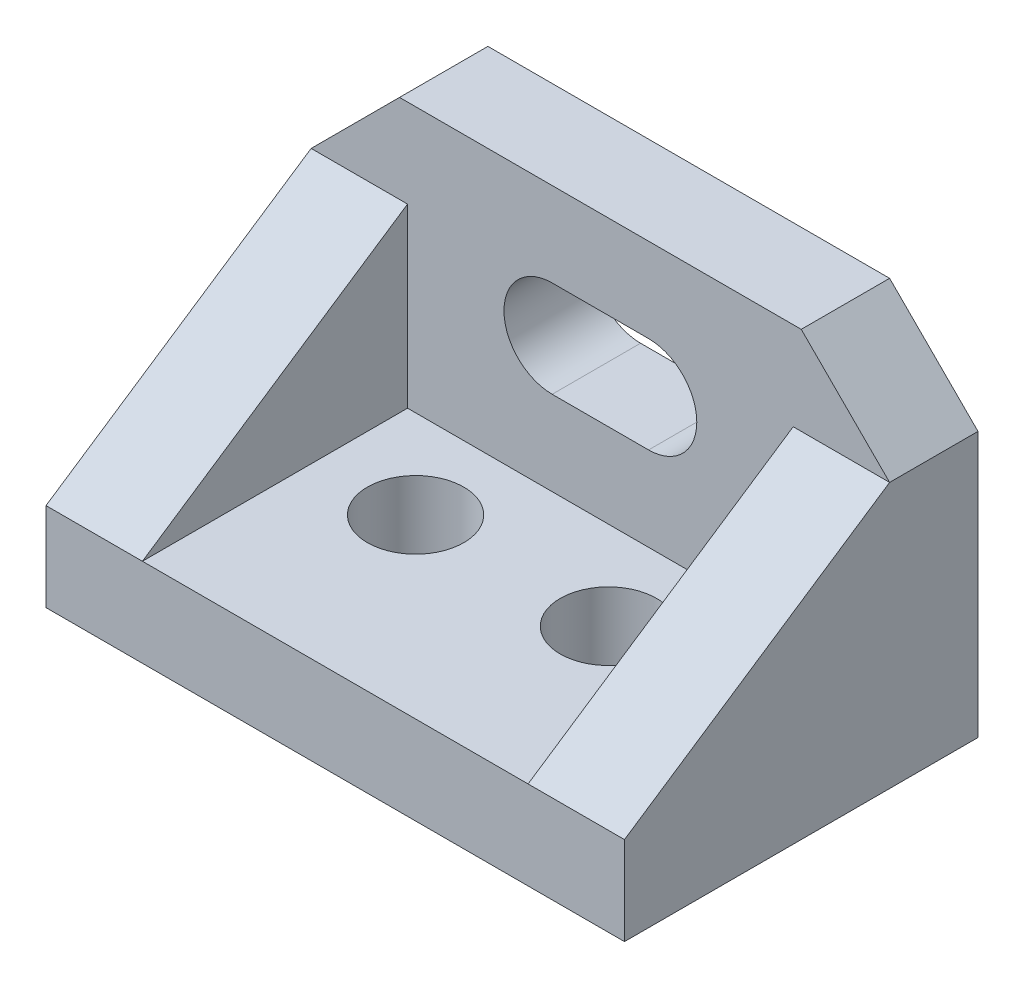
ISO-10303-21;
HEADER;
FILE_DESCRIPTION(('STEP AP214'),'2;1');
FILE_NAME('part.step','',(''),(''),'','','');
FILE_SCHEMA(('AUTOMOTIVE_DESIGN { 1 0 10303 214 1 1 1 1 }'));
ENDSEC;
DATA;
#1=APPLICATION_CONTEXT('core data for automotive mechanical design processes');
#2=APPLICATION_PROTOCOL_DEFINITION('international standard','automotive_design',2000,#1);
#3=PRODUCT_CONTEXT('',#1,'mechanical');
#4=PRODUCT('Part','Part','',(#3));
#5=PRODUCT_RELATED_PRODUCT_CATEGORY('part','',(#4));
#6=PRODUCT_DEFINITION_FORMATION('','',#4);
#7=PRODUCT_DEFINITION_CONTEXT('part definition',#1,'design');
#8=PRODUCT_DEFINITION('design','',#6,#7);
#9=PRODUCT_DEFINITION_SHAPE('','',#8);
#10=(LENGTH_UNIT() NAMED_UNIT(*) SI_UNIT(.MILLI.,.METRE.));
#11=(NAMED_UNIT(*) PLANE_ANGLE_UNIT() SI_UNIT($,.RADIAN.));
#12=(NAMED_UNIT(*) SI_UNIT($,.STERADIAN.) SOLID_ANGLE_UNIT());
#13=UNCERTAINTY_MEASURE_WITH_UNIT(LENGTH_MEASURE(1.E-05),#10,'distance_accuracy_value','');
#14=(GEOMETRIC_REPRESENTATION_CONTEXT(3) GLOBAL_UNCERTAINTY_ASSIGNED_CONTEXT((#13)) GLOBAL_UNIT_ASSIGNED_CONTEXT((#10,
#11,#12)) REPRESENTATION_CONTEXT('',''));
#15=CARTESIAN_POINT('',(0.,0.,0.));
#16=DIRECTION('',(0.,0.,1.));
#17=DIRECTION('',(1.,0.,0.));
#18=AXIS2_PLACEMENT_3D('',#15,#16,#17);
#19=CARTESIAN_POINT('',(-228.6,0.,0.));
#20=DIRECTION('',(0.,-1.,0.));
#21=DIRECTION('',(0.,0.,-1.));
#22=AXIS2_PLACEMENT_3D('',#19,#20,#21);
#23=PLANE('',#22);
#24=DIRECTION('',(0.,0.,-1.));
#25=VECTOR('',#24,1.);
#26=CARTESIAN_POINT('',(0.,0.,0.));
#27=LINE('',#26,#25);
#28=CARTESIAN_POINT('',(0.,0.,0.));
#29=VERTEX_POINT('',#28);
#30=CARTESIAN_POINT('',(0.,0.,-139.7));
#31=VERTEX_POINT('',#30);
#32=EDGE_CURVE('E298',#29,#31,#27,.T.);
#33=ORIENTED_EDGE('',*,*,#32,.F.);
#34=DIRECTION('',(1.,0.,0.));
#35=VECTOR('',#34,1.);
#36=CARTESIAN_POINT('',(-228.6,0.,0.));
#37=LINE('',#36,#35);
#38=CARTESIAN_POINT('',(-228.6,0.,0.));
#39=VERTEX_POINT('',#38);
#40=EDGE_CURVE('E12',#39,#29,#37,.T.);
#41=ORIENTED_EDGE('',*,*,#40,.F.);
#42=DIRECTION('',(0.,0.,-1.));
#43=VECTOR('',#42,1.);
#44=CARTESIAN_POINT('',(-228.6,0.,0.));
#45=LINE('',#44,#43);
#46=CARTESIAN_POINT('',(-228.6,0.,-139.7));
#47=VERTEX_POINT('',#46);
#48=EDGE_CURVE('E299',#39,#47,#45,.T.);
#49=ORIENTED_EDGE('',*,*,#48,.T.);
#50=DIRECTION('',(1.,0.,0.));
#51=VECTOR('',#50,1.);
#52=CARTESIAN_POINT('',(-228.6,0.,-139.7));
#53=LINE('',#52,#51);
#54=EDGE_CURVE('E66',#47,#31,#53,.T.);
#55=ORIENTED_EDGE('',*,*,#54,.T.);
#56=EDGE_LOOP('',(#33,#41,#49,#55));
#57=FACE_BOUND('',#56,.T.);
#58=CARTESIAN_POINT('',(-152.4,0.,-69.85));
#59=DIRECTION('',(0.,-1.,0.));
#60=DIRECTION('',(0.,0.,-1.));
#61=AXIS2_PLACEMENT_3D('',#58,#59,#60);
#62=CIRCLE('',#61,19.05);
#63=CARTESIAN_POINT('',(-152.4,0.,-50.8));
#64=VERTEX_POINT('',#63);
#65=EDGE_CURVE('E211',#64,#64,#62,.F.);
#66=ORIENTED_EDGE('',*,*,#65,.T.);
#67=EDGE_LOOP('',(#66));
#68=FACE_BOUND('',#67,.T.);
#69=CARTESIAN_POINT('',(-76.2000000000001,0.,-69.85));
#70=DIRECTION('',(0.,-1.,0.));
#71=DIRECTION('',(0.,0.,-1.));
#72=AXIS2_PLACEMENT_3D('',#69,#70,#71);
#73=CIRCLE('',#72,19.05);
#74=CARTESIAN_POINT('',(-76.2000000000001,0.,-50.8));
#75=VERTEX_POINT('',#74);
#76=EDGE_CURVE('E216',#75,#75,#73,.T.);
#77=ORIENTED_EDGE('',*,*,#76,.F.);
#78=EDGE_LOOP('',(#77));
#79=FACE_BOUND('',#78,.T.);
#80=ADVANCED_FACE('F63',(#57,#68,#79),#23,.T.);
#81=CARTESIAN_POINT('',(-228.6,34.925,0.));
#82=DIRECTION('',(0.,1.,0.));
#83=DIRECTION('',(0.,0.,1.));
#84=AXIS2_PLACEMENT_3D('',#81,#82,#83);
#85=PLANE('',#84);
#86=DIRECTION('',(0.,0.,-1.));
#87=VECTOR('',#86,1.);
#88=CARTESIAN_POINT('',(-190.5,34.925,0.));
#89=LINE('',#88,#87);
#90=CARTESIAN_POINT('',(-190.5,34.925,0.));
#91=VERTEX_POINT('',#90);
#92=CARTESIAN_POINT('',(-190.5,34.925,-104.775));
#93=VERTEX_POINT('',#92);
#94=EDGE_CURVE('E256',#91,#93,#89,.T.);
#95=ORIENTED_EDGE('',*,*,#94,.F.);
#96=DIRECTION('',(1.,0.,0.));
#97=VECTOR('',#96,1.);
#98=CARTESIAN_POINT('',(-228.6,34.925,0.));
#99=LINE('',#98,#97);
#100=CARTESIAN_POINT('',(-38.1,34.925,0.));
#101=VERTEX_POINT('',#100);
#102=EDGE_CURVE('E325',#91,#101,#99,.T.);
#103=ORIENTED_EDGE('',*,*,#102,.T.);
#104=DIRECTION('',(0.,0.,1.));
#105=VECTOR('',#104,1.);
#106=CARTESIAN_POINT('',(-38.1,34.925,-104.775));
#107=LINE('',#106,#105);
#108=CARTESIAN_POINT('',(-38.1,34.925,-104.775));
#109=VERTEX_POINT('',#108);
#110=EDGE_CURVE('E280',#109,#101,#107,.T.);
#111=ORIENTED_EDGE('',*,*,#110,.F.);
#112=DIRECTION('',(1.,0.,0.));
#113=VECTOR('',#112,1.);
#114=CARTESIAN_POINT('',(-228.6,34.925,-104.775));
#115=LINE('',#114,#113);
#116=EDGE_CURVE('E326',#93,#109,#115,.T.);
#117=ORIENTED_EDGE('',*,*,#116,.F.);
#118=EDGE_LOOP('',(#95,#103,#111,#117));
#119=FACE_BOUND('',#118,.T.);
#120=CARTESIAN_POINT('',(-152.4,34.925,-69.85));
#121=DIRECTION('',(0.,1.,0.));
#122=DIRECTION('',(0.,0.,1.));
#123=AXIS2_PLACEMENT_3D('',#120,#121,#122);
#124=CIRCLE('',#123,19.05);
#125=CARTESIAN_POINT('',(-152.4,34.925,-50.8));
#126=VERTEX_POINT('',#125);
#127=EDGE_CURVE('E217',#126,#126,#124,.T.);
#128=ORIENTED_EDGE('',*,*,#127,.F.);
#129=EDGE_LOOP('',(#128));
#130=FACE_BOUND('',#129,.T.);
#131=CARTESIAN_POINT('',(-76.2000000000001,34.925,-69.85));
#132=DIRECTION('',(0.,-1.,0.));
#133=DIRECTION('',(0.,0.,-1.));
#134=AXIS2_PLACEMENT_3D('',#131,#132,#133);
#135=CIRCLE('',#134,19.05);
#136=CARTESIAN_POINT('',(-76.2000000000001,34.925,-50.8));
#137=VERTEX_POINT('',#136);
#138=EDGE_CURVE('E212',#137,#137,#135,.T.);
#139=ORIENTED_EDGE('',*,*,#138,.T.);
#140=EDGE_LOOP('',(#139));
#141=FACE_BOUND('',#140,.T.);
#142=ADVANCED_FACE('F376',(#119,#130,#141),#85,.T.);
#143=CARTESIAN_POINT('',(-228.6,34.925,-104.775));
#144=DIRECTION('',(0.,0.,1.));
#145=DIRECTION('',(1.,0.,0.));
#146=AXIS2_PLACEMENT_3D('',#143,#144,#145);
#147=PLANE('',#146);
#148=DIRECTION('',(1.,0.,0.));
#149=VECTOR('',#148,1.);
#150=CARTESIAN_POINT('',(-133.35,68.2625,-104.775));
#151=LINE('',#150,#149);
#152=CARTESIAN_POINT('',(-133.35,68.2625,-104.775));
#153=VERTEX_POINT('',#152);
#154=CARTESIAN_POINT('',(-95.25,68.2625,-104.775));
#155=VERTEX_POINT('',#154);
#156=EDGE_CURVE('E183',#153,#155,#151,.T.);
#157=ORIENTED_EDGE('',*,*,#156,.F.);
#158=CARTESIAN_POINT('',(-133.35,87.3125,-104.775));
#159=DIRECTION('',(0.,0.,1.));
#160=DIRECTION('',(1.,0.,0.));
#161=AXIS2_PLACEMENT_3D('',#158,#159,#160);
#162=CIRCLE('',#161,19.05);
#163=CARTESIAN_POINT('',(-133.35,106.3625,-104.775));
#164=VERTEX_POINT('',#163);
#165=EDGE_CURVE('E197',#164,#153,#162,.T.);
#166=ORIENTED_EDGE('',*,*,#165,.F.);
#167=DIRECTION('',(-1.,0.,0.));
#168=VECTOR('',#167,1.);
#169=CARTESIAN_POINT('',(-133.35,106.3625,-104.775));
#170=LINE('',#169,#168);
#171=CARTESIAN_POINT('',(-95.25,106.3625,-104.775));
#172=VERTEX_POINT('',#171);
#173=EDGE_CURVE('E80',#172,#164,#170,.T.);
#174=ORIENTED_EDGE('',*,*,#173,.F.);
#175=CARTESIAN_POINT('',(-95.25,87.3125,-104.775));
#176=DIRECTION('',(0.,0.,1.));
#177=DIRECTION('',(1.,0.,0.));
#178=AXIS2_PLACEMENT_3D('',#175,#176,#177);
#179=CIRCLE('',#178,19.05);
#180=EDGE_CURVE('E193',#155,#172,#179,.T.);
#181=ORIENTED_EDGE('',*,*,#180,.F.);
#182=EDGE_LOOP('',(#157,#166,#174,#181));
#183=FACE_BOUND('',#182,.T.);
#184=DIRECTION('',(0.707106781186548,-0.707106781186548,0.));
#185=VECTOR('',#184,1.);
#186=CARTESIAN_POINT('',(52.3875,52.3875,-104.775));
#187=LINE('',#186,#185);
#188=CARTESIAN_POINT('',(-34.925,139.7,-104.775));
#189=VERTEX_POINT('',#188);
#190=CARTESIAN_POINT('',(0.,104.775,-104.775));
#191=VERTEX_POINT('',#190);
#192=EDGE_CURVE('E233',#189,#191,#187,.T.);
#193=ORIENTED_EDGE('',*,*,#192,.F.);
#194=DIRECTION('',(1.,0.,0.));
#195=VECTOR('',#194,1.);
#196=CARTESIAN_POINT('',(-228.6,139.7,-104.775));
#197=LINE('',#196,#195);
#198=CARTESIAN_POINT('',(-193.675,139.7,-104.775));
#199=VERTEX_POINT('',#198);
#200=EDGE_CURVE('E329',#199,#189,#197,.T.);
#201=ORIENTED_EDGE('',*,*,#200,.F.);
#202=DIRECTION('',(-0.707106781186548,-0.707106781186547,0.));
#203=VECTOR('',#202,1.);
#204=CARTESIAN_POINT('',(-193.675,139.7,-104.775));
#205=LINE('',#204,#203);
#206=CARTESIAN_POINT('',(-228.6,104.775,-104.775));
#207=VERTEX_POINT('',#206);
#208=EDGE_CURVE('E236',#199,#207,#205,.T.);
#209=ORIENTED_EDGE('',*,*,#208,.T.);
#210=DIRECTION('',(-1.,0.,0.));
#211=VECTOR('',#210,1.);
#212=CARTESIAN_POINT('',(-190.5,104.775,-104.775));
#213=LINE('',#212,#211);
#214=CARTESIAN_POINT('',(-190.5,104.775,-104.775));
#215=VERTEX_POINT('',#214);
#216=EDGE_CURVE('E268',#215,#207,#213,.T.);
#217=ORIENTED_EDGE('',*,*,#216,.F.);
#218=DIRECTION('',(0.,1.,0.));
#219=VECTOR('',#218,1.);
#220=CARTESIAN_POINT('',(-190.5,34.925,-104.775));
#221=LINE('',#220,#219);
#222=EDGE_CURVE('E260',#93,#215,#221,.T.);
#223=ORIENTED_EDGE('',*,*,#222,.F.);
#224=ORIENTED_EDGE('',*,*,#116,.T.);
#225=DIRECTION('',(0.,-1.,0.));
#226=VECTOR('',#225,1.);
#227=CARTESIAN_POINT('',(-38.1,104.775,-104.775));
#228=LINE('',#227,#226);
#229=CARTESIAN_POINT('',(-38.1,104.775,-104.775));
#230=VERTEX_POINT('',#229);
#231=EDGE_CURVE('E276',#230,#109,#228,.T.);
#232=ORIENTED_EDGE('',*,*,#231,.F.);
#233=DIRECTION('',(1.,0.,0.));
#234=VECTOR('',#233,1.);
#235=CARTESIAN_POINT('',(-38.1,104.775,-104.775));
#236=LINE('',#235,#234);
#237=EDGE_CURVE('E287',#230,#191,#236,.T.);
#238=ORIENTED_EDGE('',*,*,#237,.T.);
#239=EDGE_LOOP('',(#193,#201,#209,#217,#223,#224,#232,#238));
#240=FACE_BOUND('',#239,.T.);
#241=ADVANCED_FACE('F365',(#183,#240),#147,.T.);
#242=CARTESIAN_POINT('',(-228.6,139.7,-104.775));
#243=DIRECTION('',(0.,1.,0.));
#244=DIRECTION('',(0.,0.,1.));
#245=AXIS2_PLACEMENT_3D('',#242,#243,#244);
#246=PLANE('',#245);
#247=DIRECTION('',(0.,0.,1.));
#248=VECTOR('',#247,1.);
#249=CARTESIAN_POINT('',(-34.925,139.7,-139.7));
#250=LINE('',#249,#248);
#251=CARTESIAN_POINT('',(-34.925,139.7,-139.7));
#252=VERTEX_POINT('',#251);
#253=EDGE_CURVE('E232',#252,#189,#250,.T.);
#254=ORIENTED_EDGE('',*,*,#253,.F.);
#255=DIRECTION('',(1.,0.,0.));
#256=VECTOR('',#255,1.);
#257=CARTESIAN_POINT('',(-228.6,139.7,-139.7));
#258=LINE('',#257,#256);
#259=CARTESIAN_POINT('',(-193.675,139.7,-139.7));
#260=VERTEX_POINT('',#259);
#261=EDGE_CURVE('E332',#260,#252,#258,.T.);
#262=ORIENTED_EDGE('',*,*,#261,.F.);
#263=DIRECTION('',(0.,0.,1.));
#264=VECTOR('',#263,1.);
#265=CARTESIAN_POINT('',(-193.675,139.7,-139.7));
#266=LINE('',#265,#264);
#267=EDGE_CURVE('E221',#260,#199,#266,.T.);
#268=ORIENTED_EDGE('',*,*,#267,.T.);
#269=ORIENTED_EDGE('',*,*,#200,.T.);
#270=EDGE_LOOP('',(#254,#262,#268,#269));
#271=FACE_BOUND('',#270,.T.);
#272=ADVANCED_FACE('F359',(#271),#246,.T.);
#273=CARTESIAN_POINT('',(-228.6,0.,-139.7));
#274=DIRECTION('',(0.,0.,-1.));
#275=DIRECTION('',(-1.,0.,0.));
#276=AXIS2_PLACEMENT_3D('',#273,#274,#275);
#277=PLANE('',#276);
#278=DIRECTION('',(1.,0.,0.));
#279=VECTOR('',#278,1.);
#280=CARTESIAN_POINT('',(-133.35,68.2625,-139.7));
#281=LINE('',#280,#279);
#282=CARTESIAN_POINT('',(-133.35,68.2625,-139.7));
#283=VERTEX_POINT('',#282);
#284=CARTESIAN_POINT('',(-95.25,68.2625,-139.7));
#285=VERTEX_POINT('',#284);
#286=EDGE_CURVE('E180',#283,#285,#281,.T.);
#287=ORIENTED_EDGE('',*,*,#286,.T.);
#288=CARTESIAN_POINT('',(-95.25,87.3125,-139.7));
#289=DIRECTION('',(0.,0.,-1.));
#290=DIRECTION('',(-1.,0.,0.));
#291=AXIS2_PLACEMENT_3D('',#288,#289,#290);
#292=CIRCLE('',#291,19.05);
#293=CARTESIAN_POINT('',(-95.25,106.3625,-139.7));
#294=VERTEX_POINT('',#293);
#295=EDGE_CURVE('E166',#285,#294,#292,.F.);
#296=ORIENTED_EDGE('',*,*,#295,.T.);
#297=DIRECTION('',(-1.,0.,0.));
#298=VECTOR('',#297,1.);
#299=CARTESIAN_POINT('',(-133.35,106.3625,-139.7));
#300=LINE('',#299,#298);
#301=CARTESIAN_POINT('',(-133.35,106.3625,-139.7));
#302=VERTEX_POINT('',#301);
#303=EDGE_CURVE('E202',#294,#302,#300,.T.);
#304=ORIENTED_EDGE('',*,*,#303,.T.);
#305=CARTESIAN_POINT('',(-133.35,87.3125,-139.7));
#306=DIRECTION('',(0.,0.,-1.));
#307=DIRECTION('',(-1.,0.,0.));
#308=AXIS2_PLACEMENT_3D('',#305,#306,#307);
#309=CIRCLE('',#308,19.05);
#310=EDGE_CURVE('E189',#302,#283,#309,.F.);
#311=ORIENTED_EDGE('',*,*,#310,.T.);
#312=EDGE_LOOP('',(#287,#296,#304,#311));
#313=FACE_BOUND('',#312,.T.);
#314=DIRECTION('',(0.707106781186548,-0.707106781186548,0.));
#315=VECTOR('',#314,1.);
#316=CARTESIAN_POINT('',(52.3875,52.3875,-139.7));
#317=LINE('',#316,#315);
#318=CARTESIAN_POINT('',(0.,104.775,-139.7));
#319=VERTEX_POINT('',#318);
#320=EDGE_CURVE('E228',#252,#319,#317,.T.);
#321=ORIENTED_EDGE('',*,*,#320,.T.);
#322=DIRECTION('',(0.,1.,0.));
#323=VECTOR('',#322,1.);
#324=CARTESIAN_POINT('',(0.,0.,-139.7));
#325=LINE('',#324,#323);
#326=EDGE_CURVE('E315',#31,#319,#325,.T.);
#327=ORIENTED_EDGE('',*,*,#326,.F.);
#328=ORIENTED_EDGE('',*,*,#54,.F.);
#329=DIRECTION('',(0.,1.,0.));
#330=VECTOR('',#329,1.);
#331=CARTESIAN_POINT('',(-228.6,0.,-139.7));
#332=LINE('',#331,#330);
#333=CARTESIAN_POINT('',(-228.6,104.775,-139.7));
#334=VERTEX_POINT('',#333);
#335=EDGE_CURVE('E303',#47,#334,#332,.T.);
#336=ORIENTED_EDGE('',*,*,#335,.T.);
#337=DIRECTION('',(-0.707106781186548,-0.707106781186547,0.));
#338=VECTOR('',#337,1.);
#339=CARTESIAN_POINT('',(-193.675,139.7,-139.7));
#340=LINE('',#339,#338);
#341=EDGE_CURVE('E250',#260,#334,#340,.T.);
#342=ORIENTED_EDGE('',*,*,#341,.F.);
#343=ORIENTED_EDGE('',*,*,#261,.T.);
#344=EDGE_LOOP('',(#321,#327,#328,#336,#342,#343));
#345=FACE_BOUND('',#344,.T.);
#346=ADVANCED_FACE('F187',(#313,#345),#277,.T.);
#347=CARTESIAN_POINT('',(-228.6,0.,0.));
#348=DIRECTION('',(1.,0.,0.));
#349=DIRECTION('',(0.,0.,-1.));
#350=AXIS2_PLACEMENT_3D('',#347,#348,#349);
#351=PLANE('',#350);
#352=DIRECTION('',(0.,0.,1.));
#353=VECTOR('',#352,1.);
#354=CARTESIAN_POINT('',(-228.6,104.775,-139.7));
#355=LINE('',#354,#353);
#356=EDGE_CURVE('E247',#334,#207,#355,.T.);
#357=ORIENTED_EDGE('',*,*,#356,.F.);
#358=ORIENTED_EDGE('',*,*,#335,.F.);
#359=ORIENTED_EDGE('',*,*,#48,.F.);
#360=DIRECTION('',(0.,-1.,0.));
#361=VECTOR('',#360,1.);
#362=CARTESIAN_POINT('',(-228.6,0.,0.));
#363=LINE('',#362,#361);
#364=CARTESIAN_POINT('',(-228.6,34.925,0.));
#365=VERTEX_POINT('',#364);
#366=EDGE_CURVE('E308',#365,#39,#363,.T.);
#367=ORIENTED_EDGE('',*,*,#366,.F.);
#368=DIRECTION('',(0.,-0.554700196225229,0.832050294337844));
#369=VECTOR('',#368,1.);
#370=CARTESIAN_POINT('',(-228.6,104.775,-104.775));
#371=LINE('',#370,#369);
#372=EDGE_CURVE('E241',#207,#365,#371,.T.);
#373=ORIENTED_EDGE('',*,*,#372,.F.);
#374=EDGE_LOOP('',(#357,#358,#359,#367,#373));
#375=FACE_BOUND('',#374,.T.);
#376=ADVANCED_FACE('F354',(#375),#351,.F.);
#377=CARTESIAN_POINT('',(-228.6,0.,0.));
#378=DIRECTION('',(0.,0.,1.));
#379=DIRECTION('',(1.,0.,0.));
#380=AXIS2_PLACEMENT_3D('',#377,#378,#379);
#381=PLANE('',#380);
#382=DIRECTION('',(0.,-1.,0.));
#383=VECTOR('',#382,1.);
#384=CARTESIAN_POINT('',(0.,0.,0.));
#385=LINE('',#384,#383);
#386=CARTESIAN_POINT('',(0.,34.925,0.));
#387=VERTEX_POINT('',#386);
#388=EDGE_CURVE('E304',#387,#29,#385,.T.);
#389=ORIENTED_EDGE('',*,*,#388,.F.);
#390=DIRECTION('',(1.,0.,0.));
#391=VECTOR('',#390,1.);
#392=CARTESIAN_POINT('',(-38.1,34.925,0.));
#393=LINE('',#392,#391);
#394=EDGE_CURVE('E294',#101,#387,#393,.T.);
#395=ORIENTED_EDGE('',*,*,#394,.F.);
#396=ORIENTED_EDGE('',*,*,#102,.F.);
#397=EDGE_CURVE('E72',#365,#91,#99,.T.);
#398=ORIENTED_EDGE('',*,*,#397,.F.);
#399=ORIENTED_EDGE('',*,*,#366,.T.);
#400=ORIENTED_EDGE('',*,*,#40,.T.);
#401=EDGE_LOOP('',(#389,#395,#396,#398,#399,#400));
#402=FACE_BOUND('',#401,.T.);
#403=ADVANCED_FACE('F349',(#402),#381,.T.);
#404=CARTESIAN_POINT('',(0.,0.,0.));
#405=DIRECTION('',(1.,0.,0.));
#406=DIRECTION('',(0.,0.,-1.));
#407=AXIS2_PLACEMENT_3D('',#404,#405,#406);
#408=PLANE('',#407);
#409=DIRECTION('',(0.,0.,1.));
#410=VECTOR('',#409,1.);
#411=CARTESIAN_POINT('',(0.,104.775,-139.7));
#412=LINE('',#411,#410);
#413=EDGE_CURVE('E237',#319,#191,#412,.T.);
#414=ORIENTED_EDGE('',*,*,#413,.T.);
#415=DIRECTION('',(0.,0.554700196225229,-0.832050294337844));
#416=VECTOR('',#415,1.);
#417=CARTESIAN_POINT('',(0.,34.925,0.));
#418=LINE('',#417,#416);
#419=EDGE_CURVE('E275',#387,#191,#418,.T.);
#420=ORIENTED_EDGE('',*,*,#419,.F.);
#421=ORIENTED_EDGE('',*,*,#388,.T.);
#422=ORIENTED_EDGE('',*,*,#32,.T.);
#423=ORIENTED_EDGE('',*,*,#326,.T.);
#424=EDGE_LOOP('',(#414,#420,#421,#422,#423));
#425=FACE_BOUND('',#424,.T.);
#426=ADVANCED_FACE('F345',(#425),#408,.T.);
#427=CARTESIAN_POINT('',(-38.1,34.925,0.));
#428=DIRECTION('',(0.,-0.832050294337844,-0.554700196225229));
#429=DIRECTION('',(0.,0.554700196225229,-0.832050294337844));
#430=AXIS2_PLACEMENT_3D('',#427,#428,#429);
#431=PLANE('',#430);
#432=ORIENTED_EDGE('',*,*,#419,.T.);
#433=ORIENTED_EDGE('',*,*,#237,.F.);
#434=DIRECTION('',(0.,0.554700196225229,-0.832050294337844));
#435=VECTOR('',#434,1.);
#436=CARTESIAN_POINT('',(-38.1,34.925,0.));
#437=LINE('',#436,#435);
#438=EDGE_CURVE('E284',#101,#230,#437,.T.);
#439=ORIENTED_EDGE('',*,*,#438,.F.);
#440=ORIENTED_EDGE('',*,*,#394,.T.);
#441=EDGE_LOOP('',(#432,#433,#439,#440));
#442=FACE_BOUND('',#441,.T.);
#443=ADVANCED_FACE('F370',(#442),#431,.F.);
#444=CARTESIAN_POINT('',(-38.1,0.,0.));
#445=DIRECTION('',(-1.,0.,0.));
#446=DIRECTION('',(0.,0.,1.));
#447=AXIS2_PLACEMENT_3D('',#444,#445,#446);
#448=PLANE('',#447);
#449=ORIENTED_EDGE('',*,*,#231,.T.);
#450=ORIENTED_EDGE('',*,*,#110,.T.);
#451=ORIENTED_EDGE('',*,*,#438,.T.);
#452=EDGE_LOOP('',(#449,#450,#451));
#453=FACE_BOUND('',#452,.T.);
#454=ADVANCED_FACE('F372',(#453),#448,.T.);
#455=CARTESIAN_POINT('',(-190.5,104.775,-104.775));
#456=DIRECTION('',(0.,-0.832050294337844,-0.554700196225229));
#457=DIRECTION('',(0.,0.554700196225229,-0.832050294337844));
#458=AXIS2_PLACEMENT_3D('',#455,#456,#457);
#459=PLANE('',#458);
#460=ORIENTED_EDGE('',*,*,#372,.T.);
#461=ORIENTED_EDGE('',*,*,#397,.T.);
#462=DIRECTION('',(0.,-0.554700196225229,0.832050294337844));
#463=VECTOR('',#462,1.);
#464=CARTESIAN_POINT('',(-190.5,104.775,-104.775));
#465=LINE('',#464,#463);
#466=EDGE_CURVE('E264',#215,#91,#465,.T.);
#467=ORIENTED_EDGE('',*,*,#466,.F.);
#468=ORIENTED_EDGE('',*,*,#216,.T.);
#469=EDGE_LOOP('',(#460,#461,#467,#468));
#470=FACE_BOUND('',#469,.T.);
#471=ADVANCED_FACE('F383',(#470),#459,.F.);
#472=CARTESIAN_POINT('',(-190.5,0.,0.));
#473=DIRECTION('',(1.,0.,0.));
#474=DIRECTION('',(0.,0.,-1.));
#475=AXIS2_PLACEMENT_3D('',#472,#473,#474);
#476=PLANE('',#475);
#477=ORIENTED_EDGE('',*,*,#94,.T.);
#478=ORIENTED_EDGE('',*,*,#222,.T.);
#479=ORIENTED_EDGE('',*,*,#466,.T.);
#480=EDGE_LOOP('',(#477,#478,#479));
#481=FACE_BOUND('',#480,.T.);
#482=ADVANCED_FACE('F381',(#481),#476,.T.);
#483=CARTESIAN_POINT('',(52.3875,52.3875,-139.7));
#484=DIRECTION('',(-0.707106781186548,-0.707106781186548,0.));
#485=DIRECTION('',(0.707106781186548,-0.707106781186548,0.));
#486=AXIS2_PLACEMENT_3D('',#483,#484,#485);
#487=PLANE('',#486);
#488=ORIENTED_EDGE('',*,*,#192,.T.);
#489=ORIENTED_EDGE('',*,*,#413,.F.);
#490=ORIENTED_EDGE('',*,*,#320,.F.);
#491=ORIENTED_EDGE('',*,*,#253,.T.);
#492=EDGE_LOOP('',(#488,#489,#490,#491));
#493=FACE_BOUND('',#492,.T.);
#494=ADVANCED_FACE('F363',(#493),#487,.F.);
#495=CARTESIAN_POINT('',(-193.675,139.7,-139.7));
#496=DIRECTION('',(-0.707106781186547,0.707106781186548,0.));
#497=DIRECTION('',(-0.707106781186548,-0.707106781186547,0.));
#498=AXIS2_PLACEMENT_3D('',#495,#496,#497);
#499=PLANE('',#498);
#500=ORIENTED_EDGE('',*,*,#208,.F.);
#501=ORIENTED_EDGE('',*,*,#267,.F.);
#502=ORIENTED_EDGE('',*,*,#341,.T.);
#503=ORIENTED_EDGE('',*,*,#356,.T.);
#504=EDGE_LOOP('',(#500,#501,#502,#503));
#505=FACE_BOUND('',#504,.T.);
#506=ADVANCED_FACE('F384',(#505),#499,.T.);
#507=CARTESIAN_POINT('',(-152.4,-53.881536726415,-69.85));
#508=DIRECTION('',(0.,1.,0.));
#509=DIRECTION('',(0.,0.,1.));
#510=AXIS2_PLACEMENT_3D('',#507,#508,#509);
#511=CYLINDRICAL_SURFACE('',#510,19.05);
#512=CARTESIAN_POINT('',(-152.4,34.925,-50.8));
#513=CARTESIAN_POINT('',(-152.4,34.5611979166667,-50.8));
#514=CARTESIAN_POINT('',(-152.4,34.1973958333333,-50.8));
#515=CARTESIAN_POINT('',(-152.4,33.4697916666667,-50.8));
#516=CARTESIAN_POINT('',(-152.4,33.1059895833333,-50.8));
#517=CARTESIAN_POINT('',(-152.4,32.3783854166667,-50.8));
#518=CARTESIAN_POINT('',(-152.4,32.0145833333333,-50.8));
#519=CARTESIAN_POINT('',(-152.4,31.2869791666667,-50.8));
#520=CARTESIAN_POINT('',(-152.4,30.9231770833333,-50.8));
#521=CARTESIAN_POINT('',(-152.4,30.1955729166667,-50.8));
#522=CARTESIAN_POINT('',(-152.4,29.8317708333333,-50.8));
#523=CARTESIAN_POINT('',(-152.4,29.1041666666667,-50.8));
#524=CARTESIAN_POINT('',(-152.4,28.7403645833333,-50.8));
#525=CARTESIAN_POINT('',(-152.4,28.0127604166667,-50.8));
#526=CARTESIAN_POINT('',(-152.4,27.6489583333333,-50.8));
#527=CARTESIAN_POINT('',(-152.4,26.9213541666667,-50.8));
#528=CARTESIAN_POINT('',(-152.4,26.5575520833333,-50.8));
#529=CARTESIAN_POINT('',(-152.4,25.8299479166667,-50.8));
#530=CARTESIAN_POINT('',(-152.4,25.4661458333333,-50.8));
#531=CARTESIAN_POINT('',(-152.4,24.7385416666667,-50.8));
#532=CARTESIAN_POINT('',(-152.4,24.3747395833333,-50.8));
#533=CARTESIAN_POINT('',(-152.4,23.6471354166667,-50.8));
#534=CARTESIAN_POINT('',(-152.4,23.2833333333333,-50.8));
#535=CARTESIAN_POINT('',(-152.4,22.5557291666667,-50.8));
#536=CARTESIAN_POINT('',(-152.4,22.1919270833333,-50.8));
#537=CARTESIAN_POINT('',(-152.4,21.4643229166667,-50.8));
#538=CARTESIAN_POINT('',(-152.4,21.1005208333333,-50.8));
#539=CARTESIAN_POINT('',(-152.4,20.3729166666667,-50.8));
#540=CARTESIAN_POINT('',(-152.4,20.0091145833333,-50.8));
#541=CARTESIAN_POINT('',(-152.4,19.2815104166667,-50.8));
#542=CARTESIAN_POINT('',(-152.4,18.9177083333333,-50.8));
#543=CARTESIAN_POINT('',(-152.4,18.1901041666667,-50.8));
#544=CARTESIAN_POINT('',(-152.4,17.8263020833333,-50.8));
#545=CARTESIAN_POINT('',(-152.4,17.0986979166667,-50.8));
#546=CARTESIAN_POINT('',(-152.4,16.7348958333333,-50.8));
#547=CARTESIAN_POINT('',(-152.4,16.0072916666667,-50.8));
#548=CARTESIAN_POINT('',(-152.4,15.6434895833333,-50.8));
#549=CARTESIAN_POINT('',(-152.4,14.9158854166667,-50.8));
#550=CARTESIAN_POINT('',(-152.4,14.5520833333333,-50.8));
#551=CARTESIAN_POINT('',(-152.4,13.8244791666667,-50.8));
#552=CARTESIAN_POINT('',(-152.4,13.4606770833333,-50.8));
#553=CARTESIAN_POINT('',(-152.4,12.7330729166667,-50.8));
#554=CARTESIAN_POINT('',(-152.4,12.3692708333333,-50.8));
#555=CARTESIAN_POINT('',(-152.4,11.6416666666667,-50.8));
#556=CARTESIAN_POINT('',(-152.4,11.2778645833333,-50.8));
#557=CARTESIAN_POINT('',(-152.4,10.5502604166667,-50.8));
#558=CARTESIAN_POINT('',(-152.4,10.1864583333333,-50.8));
#559=CARTESIAN_POINT('',(-152.4,9.45885416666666,-50.8));
#560=CARTESIAN_POINT('',(-152.4,9.09505208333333,-50.8));
#561=CARTESIAN_POINT('',(-152.4,8.36744791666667,-50.8));
#562=CARTESIAN_POINT('',(-152.4,8.00364583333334,-50.8));
#563=CARTESIAN_POINT('',(-152.4,7.27604166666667,-50.8));
#564=CARTESIAN_POINT('',(-152.4,6.91223958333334,-50.8));
#565=CARTESIAN_POINT('',(-152.4,6.18463541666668,-50.8));
#566=CARTESIAN_POINT('',(-152.4,5.82083333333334,-50.8));
#567=CARTESIAN_POINT('',(-152.4,5.09322916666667,-50.8));
#568=CARTESIAN_POINT('',(-152.4,4.72942708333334,-50.8));
#569=CARTESIAN_POINT('',(-152.4,4.00182291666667,-50.8));
#570=CARTESIAN_POINT('',(-152.4,3.63802083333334,-50.8));
#571=CARTESIAN_POINT('',(-152.4,2.91041666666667,-50.8));
#572=CARTESIAN_POINT('',(-152.4,2.54661458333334,-50.8));
#573=CARTESIAN_POINT('',(-152.4,1.81901041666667,-50.8));
#574=CARTESIAN_POINT('',(-152.4,1.45520833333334,-50.8));
#575=CARTESIAN_POINT('',(-152.4,0.727604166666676,-50.8));
#576=CARTESIAN_POINT('',(-152.4,0.363802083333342,-50.8));
#577=CARTESIAN_POINT('',(-152.4,0.,-50.8));
#578=B_SPLINE_CURVE_WITH_KNOTS('',3,(#512,#513,#514,#515,#516,#517,#518,#519,#520,#521,#522,
#523,#524,#525,#526,#527,#528,#529,#530,#531,#532,#533,#534,#535,#536,#537,#538,#539,#540,#541,
#542,#543,#544,#545,#546,#547,#548,#549,#550,#551,#552,#553,#554,#555,#556,#557,#558,#559,#560,
#561,#562,#563,#564,#565,#566,#567,#568,#569,#570,#571,#572,#573,#574,#575,#576,#577),
.UNSPECIFIED.,.F.,.F.,(4,2,2,2,2,2,2,2,2,2,2,2,2,2,2,2,2,2,2,2,2,2,2,2,2,2,2,2,2,2,2,2,4),(0.,
1.09140625,2.18281250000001,3.27421875,4.365625,5.45703124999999,6.5484375,7.63984375,8.73125,
9.82265625,10.9140625,12.00546875,13.096875,14.18828125,15.2796875,16.37109375,17.4625,
18.55390625,19.6453125,20.73671875,21.828125,22.91953125,24.0109375,25.10234375,26.19375,
27.28515625,28.3765625,29.46796875,30.559375,31.65078125,32.7421875,33.83359375,34.925),.UNSPECIFIED.);
#579=EDGE_CURVE('BSEAM386',#126,#64,#578,.T.);
#580=ORIENTED_EDGE('',*,*,#127,.T.);
#581=ORIENTED_EDGE('',*,*,#65,.F.);
#582=ORIENTED_EDGE('',*,*,#579,.T.);
#583=ORIENTED_EDGE('',*,*,#579,.F.);
#584=EDGE_LOOP('',(#580,#582,#581,#583));
#585=FACE_BOUND('',#584,.T.);
#586=ADVANCED_FACE('F386',(#585),#511,.F.);
#587=CARTESIAN_POINT('',(-76.2000000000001,-53.881536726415,-69.85));
#588=DIRECTION('',(0.,1.,0.));
#589=DIRECTION('',(0.,0.,1.));
#590=AXIS2_PLACEMENT_3D('',#587,#588,#589);
#591=CYLINDRICAL_SURFACE('',#590,19.05);
#592=CARTESIAN_POINT('',(-76.2000000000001,34.925,-50.8));
#593=CARTESIAN_POINT('',(-76.2000000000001,34.5611979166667,-50.8));
#594=CARTESIAN_POINT('',(-76.2000000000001,34.1973958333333,-50.8));
#595=CARTESIAN_POINT('',(-76.2000000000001,33.4697916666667,-50.8));
#596=CARTESIAN_POINT('',(-76.2000000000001,33.1059895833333,-50.8));
#597=CARTESIAN_POINT('',(-76.2000000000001,32.3783854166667,-50.8));
#598=CARTESIAN_POINT('',(-76.2000000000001,32.0145833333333,-50.8));
#599=CARTESIAN_POINT('',(-76.2000000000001,31.2869791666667,-50.8));
#600=CARTESIAN_POINT('',(-76.2000000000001,30.9231770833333,-50.8));
#601=CARTESIAN_POINT('',(-76.2000000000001,30.1955729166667,-50.8));
#602=CARTESIAN_POINT('',(-76.2000000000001,29.8317708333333,-50.8));
#603=CARTESIAN_POINT('',(-76.2000000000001,29.1041666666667,-50.8));
#604=CARTESIAN_POINT('',(-76.2000000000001,28.7403645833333,-50.8));
#605=CARTESIAN_POINT('',(-76.2000000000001,28.0127604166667,-50.8));
#606=CARTESIAN_POINT('',(-76.2000000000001,27.6489583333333,-50.8));
#607=CARTESIAN_POINT('',(-76.2000000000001,26.9213541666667,-50.8));
#608=CARTESIAN_POINT('',(-76.2000000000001,26.5575520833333,-50.8));
#609=CARTESIAN_POINT('',(-76.2000000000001,25.8299479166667,-50.8));
#610=CARTESIAN_POINT('',(-76.2000000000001,25.4661458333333,-50.8));
#611=CARTESIAN_POINT('',(-76.2000000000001,24.7385416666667,-50.8));
#612=CARTESIAN_POINT('',(-76.2000000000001,24.3747395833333,-50.8));
#613=CARTESIAN_POINT('',(-76.2000000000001,23.6471354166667,-50.8));
#614=CARTESIAN_POINT('',(-76.2000000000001,23.2833333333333,-50.8));
#615=CARTESIAN_POINT('',(-76.2000000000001,22.5557291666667,-50.8));
#616=CARTESIAN_POINT('',(-76.2000000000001,22.1919270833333,-50.8));
#617=CARTESIAN_POINT('',(-76.2000000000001,21.4643229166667,-50.8));
#618=CARTESIAN_POINT('',(-76.2000000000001,21.1005208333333,-50.8));
#619=CARTESIAN_POINT('',(-76.2000000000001,20.3729166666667,-50.8));
#620=CARTESIAN_POINT('',(-76.2000000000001,20.0091145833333,-50.8));
#621=CARTESIAN_POINT('',(-76.2000000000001,19.2815104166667,-50.8));
#622=CARTESIAN_POINT('',(-76.2000000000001,18.9177083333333,-50.8));
#623=CARTESIAN_POINT('',(-76.2000000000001,18.1901041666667,-50.8));
#624=CARTESIAN_POINT('',(-76.2000000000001,17.8263020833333,-50.8));
#625=CARTESIAN_POINT('',(-76.2000000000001,17.0986979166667,-50.8));
#626=CARTESIAN_POINT('',(-76.2000000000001,16.7348958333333,-50.8));
#627=CARTESIAN_POINT('',(-76.2000000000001,16.0072916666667,-50.8));
#628=CARTESIAN_POINT('',(-76.2000000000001,15.6434895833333,-50.8));
#629=CARTESIAN_POINT('',(-76.2000000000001,14.9158854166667,-50.8));
#630=CARTESIAN_POINT('',(-76.2000000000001,14.5520833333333,-50.8));
#631=CARTESIAN_POINT('',(-76.2000000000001,13.8244791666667,-50.8));
#632=CARTESIAN_POINT('',(-76.2000000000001,13.4606770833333,-50.8));
#633=CARTESIAN_POINT('',(-76.2000000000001,12.7330729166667,-50.8));
#634=CARTESIAN_POINT('',(-76.2000000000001,12.3692708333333,-50.8));
#635=CARTESIAN_POINT('',(-76.2000000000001,11.6416666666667,-50.8));
#636=CARTESIAN_POINT('',(-76.2000000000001,11.2778645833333,-50.8));
#637=CARTESIAN_POINT('',(-76.2000000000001,10.5502604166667,-50.8));
#638=CARTESIAN_POINT('',(-76.2000000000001,10.1864583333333,-50.8));
#639=CARTESIAN_POINT('',(-76.2000000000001,9.45885416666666,-50.8));
#640=CARTESIAN_POINT('',(-76.2000000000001,9.09505208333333,-50.8));
#641=CARTESIAN_POINT('',(-76.2000000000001,8.36744791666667,-50.8));
#642=CARTESIAN_POINT('',(-76.2000000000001,8.00364583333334,-50.8));
#643=CARTESIAN_POINT('',(-76.2000000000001,7.27604166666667,-50.8));
#644=CARTESIAN_POINT('',(-76.2000000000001,6.91223958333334,-50.8));
#645=CARTESIAN_POINT('',(-76.2000000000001,6.18463541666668,-50.8));
#646=CARTESIAN_POINT('',(-76.2000000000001,5.82083333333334,-50.8));
#647=CARTESIAN_POINT('',(-76.2000000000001,5.09322916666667,-50.8));
#648=CARTESIAN_POINT('',(-76.2000000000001,4.72942708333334,-50.8));
#649=CARTESIAN_POINT('',(-76.2000000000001,4.00182291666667,-50.8));
#650=CARTESIAN_POINT('',(-76.2000000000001,3.63802083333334,-50.8));
#651=CARTESIAN_POINT('',(-76.2000000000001,2.91041666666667,-50.8));
#652=CARTESIAN_POINT('',(-76.2000000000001,2.54661458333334,-50.8));
#653=CARTESIAN_POINT('',(-76.2000000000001,1.81901041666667,-50.8));
#654=CARTESIAN_POINT('',(-76.2000000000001,1.45520833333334,-50.8));
#655=CARTESIAN_POINT('',(-76.2000000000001,0.727604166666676,-50.8));
#656=CARTESIAN_POINT('',(-76.2000000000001,0.363802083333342,-50.8));
#657=CARTESIAN_POINT('',(-76.2000000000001,0.,-50.8));
#658=B_SPLINE_CURVE_WITH_KNOTS('',3,(#592,#593,#594,#595,#596,#597,#598,#599,#600,#601,#602,
#603,#604,#605,#606,#607,#608,#609,#610,#611,#612,#613,#614,#615,#616,#617,#618,#619,#620,#621,
#622,#623,#624,#625,#626,#627,#628,#629,#630,#631,#632,#633,#634,#635,#636,#637,#638,#639,#640,
#641,#642,#643,#644,#645,#646,#647,#648,#649,#650,#651,#652,#653,#654,#655,#656,#657),
.UNSPECIFIED.,.F.,.F.,(4,2,2,2,2,2,2,2,2,2,2,2,2,2,2,2,2,2,2,2,2,2,2,2,2,2,2,2,2,2,2,2,4),(0.,
1.09140625,2.18281250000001,3.27421875,4.365625,5.45703124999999,6.5484375,7.63984375,8.73125,
9.82265625,10.9140625,12.00546875,13.096875,14.18828125,15.2796875,16.37109375,17.4625,
18.55390625,19.6453125,20.73671875,21.828125,22.91953125,24.0109375,25.10234375,26.19375,
27.28515625,28.3765625,29.46796875,30.559375,31.65078125,32.7421875,33.83359375,34.925),.UNSPECIFIED.);
#659=EDGE_CURVE('BSEAM393',#137,#75,#658,.T.);
#660=ORIENTED_EDGE('',*,*,#138,.F.);
#661=ORIENTED_EDGE('',*,*,#76,.T.);
#662=ORIENTED_EDGE('',*,*,#659,.T.);
#663=ORIENTED_EDGE('',*,*,#659,.F.);
#664=EDGE_LOOP('',(#660,#662,#661,#663));
#665=FACE_BOUND('',#664,.T.);
#666=ADVANCED_FACE('F393',(#665),#591,.F.);
#667=CARTESIAN_POINT('',(-133.35,68.2625,-224.894189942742));
#668=DIRECTION('',(0.,-1.,0.));
#669=DIRECTION('',(1.,0.,0.));
#670=AXIS2_PLACEMENT_3D('',#667,#668,#669);
#671=PLANE('',#670);
#672=DIRECTION('',(0.,0.,1.));
#673=VECTOR('',#672,1.);
#674=CARTESIAN_POINT('',(-133.35,68.2625,-224.894189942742));
#675=LINE('',#674,#673);
#676=EDGE_CURVE('E88',#283,#153,#675,.T.);
#677=ORIENTED_EDGE('',*,*,#676,.T.);
#678=ORIENTED_EDGE('',*,*,#156,.T.);
#679=DIRECTION('',(0.,0.,1.));
#680=VECTOR('',#679,1.);
#681=CARTESIAN_POINT('',(-95.25,68.2625,-224.894189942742));
#682=LINE('',#681,#680);
#683=EDGE_CURVE('E170',#285,#155,#682,.T.);
#684=ORIENTED_EDGE('',*,*,#683,.F.);
#685=ORIENTED_EDGE('',*,*,#286,.F.);
#686=EDGE_LOOP('',(#677,#678,#684,#685));
#687=FACE_BOUND('',#686,.T.);
#688=ADVANCED_FACE('F179',(#687),#671,.F.);
#689=CARTESIAN_POINT('',(-95.25,87.3125,-224.894189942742));
#690=DIRECTION('',(0.,0.,1.));
#691=DIRECTION('',(1.,0.,0.));
#692=AXIS2_PLACEMENT_3D('',#689,#690,#691);
#693=CYLINDRICAL_SURFACE('',#692,19.05);
#694=ORIENTED_EDGE('',*,*,#683,.T.);
#695=ORIENTED_EDGE('',*,*,#180,.T.);
#696=DIRECTION('',(0.,0.,1.));
#697=VECTOR('',#696,1.);
#698=CARTESIAN_POINT('',(-95.25,106.3625,-224.894189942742));
#699=LINE('',#698,#697);
#700=EDGE_CURVE('E172',#294,#172,#699,.T.);
#701=ORIENTED_EDGE('',*,*,#700,.F.);
#702=ORIENTED_EDGE('',*,*,#295,.F.);
#703=EDGE_LOOP('',(#694,#695,#701,#702));
#704=FACE_BOUND('',#703,.T.);
#705=ADVANCED_FACE('F168',(#704),#693,.F.);
#706=CARTESIAN_POINT('',(-133.35,106.3625,-224.894189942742));
#707=DIRECTION('',(0.,1.,0.));
#708=DIRECTION('',(-1.,0.,0.));
#709=AXIS2_PLACEMENT_3D('',#706,#707,#708);
#710=PLANE('',#709);
#711=ORIENTED_EDGE('',*,*,#700,.T.);
#712=ORIENTED_EDGE('',*,*,#173,.T.);
#713=DIRECTION('',(0.,0.,1.));
#714=VECTOR('',#713,1.);
#715=CARTESIAN_POINT('',(-133.35,106.3625,-224.894189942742));
#716=LINE('',#715,#714);
#717=EDGE_CURVE('E201',#302,#164,#716,.T.);
#718=ORIENTED_EDGE('',*,*,#717,.F.);
#719=ORIENTED_EDGE('',*,*,#303,.F.);
#720=EDGE_LOOP('',(#711,#712,#718,#719));
#721=FACE_BOUND('',#720,.T.);
#722=ADVANCED_FACE('F499',(#721),#710,.F.);
#723=CARTESIAN_POINT('',(-133.35,87.3125,-224.894189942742));
#724=DIRECTION('',(0.,0.,1.));
#725=DIRECTION('',(1.,0.,0.));
#726=AXIS2_PLACEMENT_3D('',#723,#724,#725);
#727=CYLINDRICAL_SURFACE('',#726,19.05);
#728=ORIENTED_EDGE('',*,*,#717,.T.);
#729=ORIENTED_EDGE('',*,*,#165,.T.);
#730=ORIENTED_EDGE('',*,*,#676,.F.);
#731=ORIENTED_EDGE('',*,*,#310,.F.);
#732=EDGE_LOOP('',(#728,#729,#730,#731));
#733=FACE_BOUND('',#732,.T.);
#734=ADVANCED_FACE('F507',(#733),#727,.F.);
#735=CLOSED_SHELL('',(#80,#142,#241,#272,#346,#376,#403,#426,#443,#454,#471,#482,#494,#506,#586,
#666,#688,#705,#722,#734));
#736=MANIFOLD_SOLID_BREP('B2',#735);
#737=ADVANCED_BREP_SHAPE_REPRESENTATION('',(#18,#736),#14);
#738=SHAPE_DEFINITION_REPRESENTATION(#9,#737);
ENDSEC;
END-ISO-10303-21;
